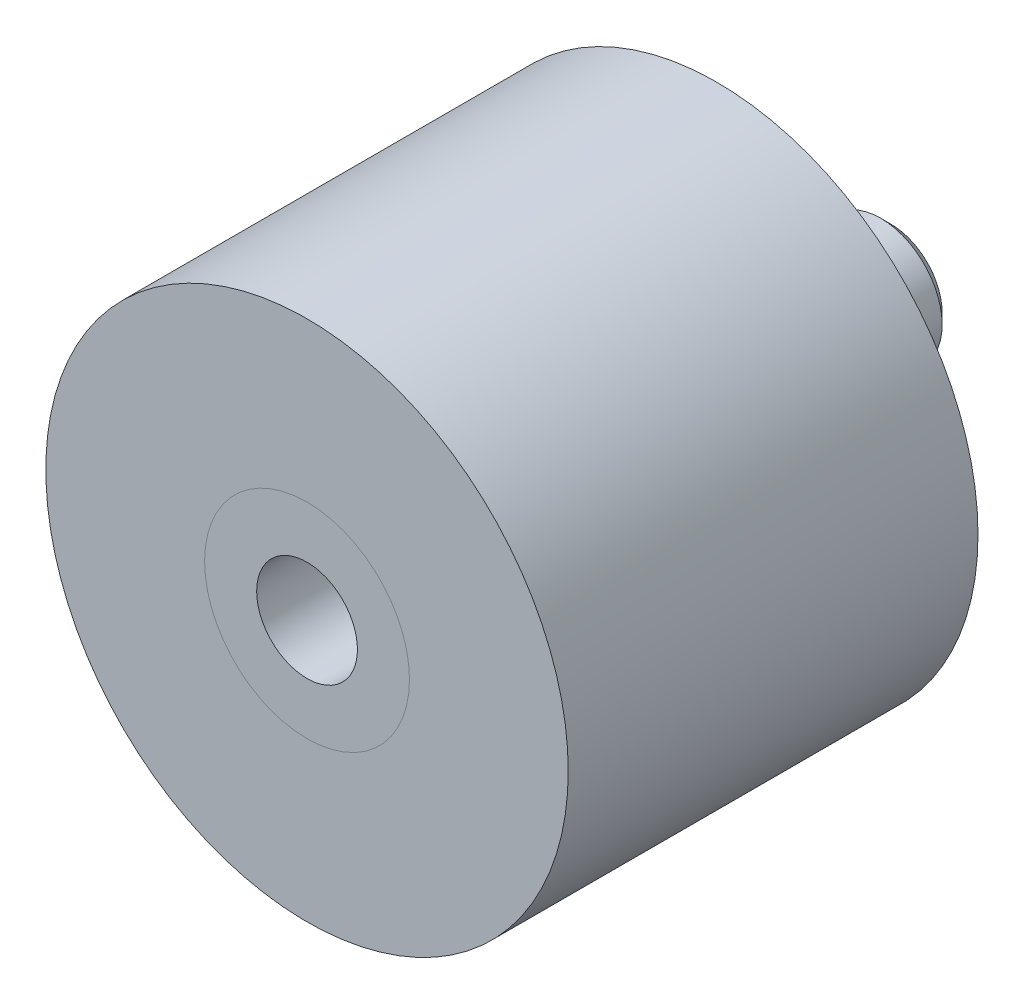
ISO-10303-21;
HEADER;
FILE_DESCRIPTION(('STEP AP214'),'2;1');
FILE_NAME('part.step','',(''),(''),'','','');
FILE_SCHEMA(('AUTOMOTIVE_DESIGN { 1 0 10303 214 1 1 1 1 }'));
ENDSEC;
DATA;
#1=APPLICATION_CONTEXT('core data for automotive mechanical design processes');
#2=APPLICATION_PROTOCOL_DEFINITION('international standard','automotive_design',2000,#1);
#3=PRODUCT_CONTEXT('',#1,'mechanical');
#4=PRODUCT('Part','Part','',(#3));
#5=PRODUCT_RELATED_PRODUCT_CATEGORY('part','',(#4));
#6=PRODUCT_DEFINITION_FORMATION('','',#4);
#7=PRODUCT_DEFINITION_CONTEXT('part definition',#1,'design');
#8=PRODUCT_DEFINITION('design','',#6,#7);
#9=PRODUCT_DEFINITION_SHAPE('','',#8);
#10=(LENGTH_UNIT() NAMED_UNIT(*) SI_UNIT(.MILLI.,.METRE.));
#11=(NAMED_UNIT(*) PLANE_ANGLE_UNIT() SI_UNIT($,.RADIAN.));
#12=(NAMED_UNIT(*) SI_UNIT($,.STERADIAN.) SOLID_ANGLE_UNIT());
#13=UNCERTAINTY_MEASURE_WITH_UNIT(LENGTH_MEASURE(1.E-05),#10,'distance_accuracy_value','');
#14=(GEOMETRIC_REPRESENTATION_CONTEXT(3) GLOBAL_UNCERTAINTY_ASSIGNED_CONTEXT((#13)) GLOBAL_UNIT_ASSIGNED_CONTEXT((#10,
#11,#12)) REPRESENTATION_CONTEXT('',''));
#15=CARTESIAN_POINT('',(0.,0.,0.));
#16=DIRECTION('',(0.,0.,1.));
#17=DIRECTION('',(1.,0.,0.));
#18=AXIS2_PLACEMENT_3D('',#15,#16,#17);
#19=CARTESIAN_POINT('',(0.,0.,9.73));
#20=DIRECTION('',(0.,0.,-1.));
#21=DIRECTION('',(-1.,0.,0.));
#22=AXIS2_PLACEMENT_3D('',#19,#20,#21);
#23=PLANE('',#22);
#24=CARTESIAN_POINT('',(0.,0.,9.73));
#25=DIRECTION('',(0.,0.,-1.));
#26=DIRECTION('',(-1.,0.,0.));
#27=AXIS2_PLACEMENT_3D('',#24,#25,#26);
#28=CIRCLE('',#27,2.4585);
#29=CARTESIAN_POINT('',(-2.4585,0.,9.73));
#30=VERTEX_POINT('',#29);
#31=EDGE_CURVE('P0_E19',#30,#30,#28,.F.);
#32=ORIENTED_EDGE('',*,*,#31,.T.);
#33=EDGE_LOOP('',(#32));
#34=FACE_BOUND('',#33,.T.);
#35=ADVANCED_FACE('P0_F16',(#34),#23,.F.);
#36=CARTESIAN_POINT('',(0.,0.,14.9));
#37=DIRECTION('',(0.,0.,-1.));
#38=DIRECTION('',(-1.,0.,0.));
#39=AXIS2_PLACEMENT_3D('',#36,#37,#38);
#40=CYLINDRICAL_SURFACE('',#39,2.4585);
#41=ORIENTED_EDGE('',*,*,#31,.F.);
#42=EDGE_LOOP('',(#41));
#43=FACE_BOUND('',#42,.T.);
#44=CARTESIAN_POINT('',(0.,0.,15.));
#45=DIRECTION('',(0.,0.,-1.));
#46=DIRECTION('',(-1.,0.,0.));
#47=AXIS2_PLACEMENT_3D('',#44,#45,#46);
#48=CIRCLE('',#47,2.4585);
#49=CARTESIAN_POINT('',(-2.4585,0.,15.));
#50=VERTEX_POINT('',#49);
#51=EDGE_CURVE('P0_E99',#50,#50,#48,.T.);
#52=ORIENTED_EDGE('',*,*,#51,.F.);
#53=EDGE_LOOP('',(#52));
#54=FACE_BOUND('',#53,.T.);
#55=ADVANCED_FACE('P0_F107',(#43,#54),#40,.F.);
#56=CARTESIAN_POINT('',(0.,0.,15.));
#57=DIRECTION('',(0.,0.,1.));
#58=DIRECTION('',(1.,0.,0.));
#59=AXIS2_PLACEMENT_3D('',#56,#57,#58);
#60=PLANE('',#59);
#61=ORIENTED_EDGE('',*,*,#51,.T.);
#62=EDGE_LOOP('',(#61));
#63=FACE_BOUND('',#62,.T.);
#64=CARTESIAN_POINT('',(0.,0.,15.));
#65=DIRECTION('',(0.,0.,1.));
#66=DIRECTION('',(1.,0.,0.));
#67=AXIS2_PLACEMENT_3D('',#64,#65,#66);
#68=CIRCLE('',#67,5.);
#69=CARTESIAN_POINT('',(5.,0.,15.));
#70=VERTEX_POINT('',#69);
#71=EDGE_CURVE('P0_E97',#70,#70,#68,.F.);
#72=ORIENTED_EDGE('',*,*,#71,.F.);
#73=EDGE_LOOP('',(#72));
#74=FACE_BOUND('',#73,.T.);
#75=ADVANCED_FACE('P0_F110',(#63,#74),#60,.T.);
#76=CARTESIAN_POINT('',(0.,0.,10.));
#77=DIRECTION('',(0.,0.,1.));
#78=DIRECTION('',(1.,0.,0.));
#79=AXIS2_PLACEMENT_3D('',#76,#77,#78);
#80=CYLINDRICAL_SURFACE('',#79,5.);
#81=ORIENTED_EDGE('',*,*,#71,.T.);
#82=EDGE_LOOP('',(#81));
#83=FACE_BOUND('',#82,.T.);
#84=CARTESIAN_POINT('',(0.,0.,5.));
#85=DIRECTION('',(0.,0.,1.));
#86=DIRECTION('',(1.,0.,0.));
#87=AXIS2_PLACEMENT_3D('',#84,#85,#86);
#88=CIRCLE('',#87,5.);
#89=CARTESIAN_POINT('',(5.,0.,5.));
#90=VERTEX_POINT('',#89);
#91=EDGE_CURVE('P0_E80',#90,#90,#88,.F.);
#92=ORIENTED_EDGE('',*,*,#91,.F.);
#93=EDGE_LOOP('',(#92));
#94=FACE_BOUND('',#93,.T.);
#95=ADVANCED_FACE('P0_F116',(#83,#94),#80,.T.);
#96=CARTESIAN_POINT('',(0.,0.,5.));
#97=DIRECTION('',(0.,0.,1.));
#98=DIRECTION('',(1.,0.,0.));
#99=AXIS2_PLACEMENT_3D('',#96,#97,#98);
#100=PLANE('',#99);
#101=ORIENTED_EDGE('',*,*,#91,.T.);
#102=EDGE_LOOP('',(#101));
#103=FACE_BOUND('',#102,.T.);
#104=DIRECTION('',(0.303957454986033,0.952685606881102,0.));
#105=VECTOR('',#104,1.);
#106=CARTESIAN_POINT('',(8.88438226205,1.93784721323,5.));
#107=LINE('',#106,#105);
#108=CARTESIAN_POINT('',(8.88438226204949,1.93784721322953,5.));
#109=VERTEX_POINT('',#108);
#110=CARTESIAN_POINT('',(6.1204160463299,-6.72517712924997,5.));
#111=VERTEX_POINT('',#110);
#112=EDGE_CURVE('P0_E66',#109,#111,#107,.F.);
#113=ORIENTED_EDGE('',*,*,#112,.F.);
#114=DIRECTION('',(-0.673071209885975,0.739577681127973,0.));
#115=VECTOR('',#114,1.);
#116=CARTESIAN_POINT('',(2.76396621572,8.66302434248,5.));
#117=LINE('',#116,#115);
#118=CARTESIAN_POINT('',(2.76396621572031,8.66302434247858,5.));
#119=VERTEX_POINT('',#118);
#120=EDGE_CURVE('P0_E71',#119,#109,#117,.F.);
#121=ORIENTED_EDGE('',*,*,#120,.F.);
#122=DIRECTION('',(-0.977028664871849,-0.213107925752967,0.));
#123=VECTOR('',#122,1.);
#124=CARTESIAN_POINT('',(-6.12041604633,6.72517712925,5.));
#125=LINE('',#124,#123);
#126=CARTESIAN_POINT('',(-6.1204160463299,6.72517712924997,5.));
#127=VERTEX_POINT('',#126);
#128=EDGE_CURVE('P0_E254',#127,#119,#125,.F.);
#129=ORIENTED_EDGE('',*,*,#128,.F.);
#130=DIRECTION('',(-0.303957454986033,-0.952685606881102,0.));
#131=VECTOR('',#130,1.);
#132=CARTESIAN_POINT('',(-8.88438226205,-1.93784721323,5.));
#133=LINE('',#132,#131);
#134=CARTESIAN_POINT('',(-8.88438226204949,-1.93784721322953,5.));
#135=VERTEX_POINT('',#134);
#136=EDGE_CURVE('P0_E257',#135,#127,#133,.F.);
#137=ORIENTED_EDGE('',*,*,#136,.F.);
#138=DIRECTION('',(0.673071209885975,-0.739577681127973,0.));
#139=VECTOR('',#138,1.);
#140=CARTESIAN_POINT('',(-2.76396621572,-8.66302434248,5.));
#141=LINE('',#140,#139);
#142=CARTESIAN_POINT('',(-2.76396621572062,-8.66302434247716,5.));
#143=VERTEX_POINT('',#142);
#144=EDGE_CURVE('P0_E240',#143,#135,#141,.F.);
#145=ORIENTED_EDGE('',*,*,#144,.F.);
#146=DIRECTION('',(0.977028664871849,0.213107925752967,0.));
#147=VECTOR('',#146,1.);
#148=CARTESIAN_POINT('',(6.12041604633,-6.72517712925,5.));
#149=LINE('',#148,#147);
#150=EDGE_CURVE('P0_E84',#111,#143,#149,.F.);
#151=ORIENTED_EDGE('',*,*,#150,.F.);
#152=EDGE_LOOP('',(#113,#121,#129,#137,#145,#151));
#153=FACE_BOUND('',#152,.T.);
#154=ADVANCED_FACE('P0_F82',(#103,#153),#100,.T.);
#155=CARTESIAN_POINT('',(2.76396621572,8.66302434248,5.));
#156=DIRECTION('',(0.739577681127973,0.673071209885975,0.));
#157=DIRECTION('',(-0.673071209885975,0.739577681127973,0.));
#158=AXIS2_PLACEMENT_3D('',#155,#156,#157);
#159=PLANE('',#158);
#160=DIRECTION('',(0.,0.,1.));
#161=VECTOR('',#160,1.);
#162=CARTESIAN_POINT('',(8.88438226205,1.93784721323,5.));
#163=LINE('',#162,#161);
#164=CARTESIAN_POINT('',(8.88438226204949,1.93784721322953,2.45));
#165=VERTEX_POINT('',#164);
#166=EDGE_CURVE('P0_E73',#165,#109,#163,.T.);
#167=ORIENTED_EDGE('',*,*,#166,.F.);
#168=DIRECTION('',(0.673071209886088,-0.73957768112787,0.));
#169=VECTOR('',#168,1.);
#170=CARTESIAN_POINT('',(2.76396621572,8.66302434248,2.45));
#171=LINE('',#170,#169);
#172=CARTESIAN_POINT('',(2.76396621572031,8.66302434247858,2.45));
#173=VERTEX_POINT('',#172);
#174=EDGE_CURVE('P0_E248',#173,#165,#171,.T.);
#175=ORIENTED_EDGE('',*,*,#174,.F.);
#176=DIRECTION('',(0.,0.,1.));
#177=VECTOR('',#176,1.);
#178=CARTESIAN_POINT('',(2.76396621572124,8.66302434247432,5.));
#179=LINE('',#178,#177);
#180=EDGE_CURVE('P0_E76',#119,#173,#179,.F.);
#181=ORIENTED_EDGE('',*,*,#180,.F.);
#182=ORIENTED_EDGE('',*,*,#120,.T.);
#183=EDGE_LOOP('',(#167,#175,#181,#182));
#184=FACE_BOUND('',#183,.T.);
#185=ADVANCED_FACE('P0_F72',(#184),#159,.T.);
#186=CARTESIAN_POINT('',(8.88438226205,1.93784721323,5.));
#187=DIRECTION('',(0.952685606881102,-0.303957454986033,0.));
#188=DIRECTION('',(0.303957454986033,0.952685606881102,0.));
#189=AXIS2_PLACEMENT_3D('',#186,#187,#188);
#190=PLANE('',#189);
#191=DIRECTION('',(0.,0.,1.));
#192=VECTOR('',#191,1.);
#193=CARTESIAN_POINT('',(6.12041604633,-6.72517712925,5.));
#194=LINE('',#193,#192);
#195=CARTESIAN_POINT('',(6.1204160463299,-6.72517712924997,2.45));
#196=VERTEX_POINT('',#195);
#197=EDGE_CURVE('P0_E86',#196,#111,#194,.T.);
#198=ORIENTED_EDGE('',*,*,#197,.F.);
#199=DIRECTION('',(-0.303957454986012,-0.952685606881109,0.));
#200=VECTOR('',#199,1.);
#201=CARTESIAN_POINT('',(8.88438226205,1.93784721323,2.45));
#202=LINE('',#201,#200);
#203=EDGE_CURVE('P0_E90',#165,#196,#202,.T.);
#204=ORIENTED_EDGE('',*,*,#203,.F.);
#205=ORIENTED_EDGE('',*,*,#166,.T.);
#206=ORIENTED_EDGE('',*,*,#112,.T.);
#207=EDGE_LOOP('',(#198,#204,#205,#206));
#208=FACE_BOUND('',#207,.T.);
#209=ADVANCED_FACE('P0_F88',(#208),#190,.T.);
#210=CARTESIAN_POINT('',(6.12041604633,-6.72517712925,5.));
#211=DIRECTION('',(0.213107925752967,-0.977028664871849,0.));
#212=DIRECTION('',(0.977028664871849,0.213107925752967,0.));
#213=AXIS2_PLACEMENT_3D('',#210,#211,#212);
#214=PLANE('',#213);
#215=DIRECTION('',(0.,0.,1.));
#216=VECTOR('',#215,1.);
#217=CARTESIAN_POINT('',(-2.76396621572,-8.66302434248,5.));
#218=LINE('',#217,#216);
#219=CARTESIAN_POINT('',(-2.76396621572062,-8.66302434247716,2.45));
#220=VERTEX_POINT('',#219);
#221=EDGE_CURVE('P0_E236',#220,#143,#218,.T.);
#222=ORIENTED_EDGE('',*,*,#221,.F.);
#223=DIRECTION('',(-0.977028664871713,-0.213107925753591,0.));
#224=VECTOR('',#223,1.);
#225=CARTESIAN_POINT('',(6.12041604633,-6.72517712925,2.45));
#226=LINE('',#225,#224);
#227=EDGE_CURVE('P0_E239',#196,#220,#226,.T.);
#228=ORIENTED_EDGE('',*,*,#227,.F.);
#229=ORIENTED_EDGE('',*,*,#197,.T.);
#230=ORIENTED_EDGE('',*,*,#150,.T.);
#231=EDGE_LOOP('',(#222,#228,#229,#230));
#232=FACE_BOUND('',#231,.T.);
#233=ADVANCED_FACE('P0_F137',(#232),#214,.T.);
#234=CARTESIAN_POINT('',(-2.76396621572,-8.66302434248,5.));
#235=DIRECTION('',(-0.739577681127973,-0.673071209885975,0.));
#236=DIRECTION('',(0.673071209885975,-0.739577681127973,0.));
#237=AXIS2_PLACEMENT_3D('',#234,#235,#236);
#238=PLANE('',#237);
#239=DIRECTION('',(0.,0.,1.));
#240=VECTOR('',#239,1.);
#241=CARTESIAN_POINT('',(-8.88438226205,-1.93784721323,5.));
#242=LINE('',#241,#240);
#243=CARTESIAN_POINT('',(-8.88438226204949,-1.93784721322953,2.45));
#244=VERTEX_POINT('',#243);
#245=EDGE_CURVE('P0_E245',#244,#135,#242,.T.);
#246=ORIENTED_EDGE('',*,*,#245,.F.);
#247=DIRECTION('',(-0.673071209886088,0.73957768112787,0.));
#248=VECTOR('',#247,1.);
#249=CARTESIAN_POINT('',(-2.76396621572,-8.66302434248,2.45));
#250=LINE('',#249,#248);
#251=EDGE_CURVE('P0_E243',#220,#244,#250,.T.);
#252=ORIENTED_EDGE('',*,*,#251,.F.);
#253=ORIENTED_EDGE('',*,*,#221,.T.);
#254=ORIENTED_EDGE('',*,*,#144,.T.);
#255=EDGE_LOOP('',(#246,#252,#253,#254));
#256=FACE_BOUND('',#255,.T.);
#257=ADVANCED_FACE('P0_F134',(#256),#238,.T.);
#258=CARTESIAN_POINT('',(-8.88438226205,-1.93784721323,5.));
#259=DIRECTION('',(-0.952685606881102,0.303957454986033,0.));
#260=DIRECTION('',(-0.303957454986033,-0.952685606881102,0.));
#261=AXIS2_PLACEMENT_3D('',#258,#259,#260);
#262=PLANE('',#261);
#263=DIRECTION('',(0.,0.,1.));
#264=VECTOR('',#263,1.);
#265=CARTESIAN_POINT('',(-6.12041604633,6.72517712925,5.));
#266=LINE('',#265,#264);
#267=CARTESIAN_POINT('',(-6.1204160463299,6.72517712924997,2.45));
#268=VERTEX_POINT('',#267);
#269=EDGE_CURVE('P0_E34',#268,#127,#266,.T.);
#270=ORIENTED_EDGE('',*,*,#269,.F.);
#271=DIRECTION('',(0.303957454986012,0.952685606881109,0.));
#272=VECTOR('',#271,1.);
#273=CARTESIAN_POINT('',(-8.88438226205,-1.93784721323,2.45));
#274=LINE('',#273,#272);
#275=EDGE_CURVE('P0_E25',#244,#268,#274,.T.);
#276=ORIENTED_EDGE('',*,*,#275,.F.);
#277=ORIENTED_EDGE('',*,*,#245,.T.);
#278=ORIENTED_EDGE('',*,*,#136,.T.);
#279=EDGE_LOOP('',(#270,#276,#277,#278));
#280=FACE_BOUND('',#279,.T.);
#281=ADVANCED_FACE('P0_F127',(#280),#262,.T.);
#282=CARTESIAN_POINT('',(-6.12041604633,6.72517712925,5.));
#283=DIRECTION('',(-0.213107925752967,0.977028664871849,0.));
#284=DIRECTION('',(-0.977028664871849,-0.213107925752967,0.));
#285=AXIS2_PLACEMENT_3D('',#282,#283,#284);
#286=PLANE('',#285);
#287=ORIENTED_EDGE('',*,*,#180,.T.);
#288=DIRECTION('',(0.977028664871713,0.213107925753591,0.));
#289=VECTOR('',#288,1.);
#290=CARTESIAN_POINT('',(-6.12041604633,6.72517712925,2.45));
#291=LINE('',#290,#289);
#292=EDGE_CURVE('P0_E11',#268,#173,#291,.T.);
#293=ORIENTED_EDGE('',*,*,#292,.F.);
#294=ORIENTED_EDGE('',*,*,#269,.T.);
#295=ORIENTED_EDGE('',*,*,#128,.T.);
#296=EDGE_LOOP('',(#287,#293,#294,#295));
#297=FACE_BOUND('',#296,.T.);
#298=ADVANCED_FACE('P0_F121',(#297),#286,.T.);
#299=CARTESIAN_POINT('',(0.,0.,2.45));
#300=DIRECTION('',(0.,0.,-1.));
#301=DIRECTION('',(-1.,0.,0.));
#302=AXIS2_PLACEMENT_3D('',#299,#300,#301);
#303=PLANE('',#302);
#304=ORIENTED_EDGE('',*,*,#275,.T.);
#305=ORIENTED_EDGE('',*,*,#292,.T.);
#306=ORIENTED_EDGE('',*,*,#174,.T.);
#307=ORIENTED_EDGE('',*,*,#203,.T.);
#308=ORIENTED_EDGE('',*,*,#227,.T.);
#309=ORIENTED_EDGE('',*,*,#251,.T.);
#310=EDGE_LOOP('',(#304,#305,#306,#307,#308,#309));
#311=FACE_BOUND('',#310,.T.);
#312=ADVANCED_FACE('P0_F119',(#311),#303,.T.);
#313=CLOSED_SHELL('',(#35,#55,#75,#95,#154,#185,#209,#233,#257,#281,#298,#312));
#314=MANIFOLD_SOLID_BREP('P0_B1',#313);
#315=CARTESIAN_POINT('',(0.,0.,0.));
#316=DIRECTION('',(0.,0.,1.));
#317=DIRECTION('',(1.,0.,0.));
#318=AXIS2_PLACEMENT_3D('',#315,#316,#317);
#319=PLANE('',#318);
#320=DIRECTION('',(-0.866025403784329,0.50000000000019,0.));
#321=VECTOR('',#320,1.);
#322=CARTESIAN_POINT('',(-7.5,-4.33012701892,0.));
#323=LINE('',#322,#321);
#324=CARTESIAN_POINT('',(-7.5,-4.33012701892,0.));
#325=VERTEX_POINT('',#324);
#326=CARTESIAN_POINT('',(-9.36949879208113E-13,-8.66025403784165,0.));
#327=VERTEX_POINT('',#326);
#328=EDGE_CURVE('P1_E212',#325,#327,#323,.F.);
#329=ORIENTED_EDGE('',*,*,#328,.F.);
#330=DIRECTION('',(0.,1.,0.));
#331=VECTOR('',#330,1.);
#332=CARTESIAN_POINT('',(-7.5,4.33012701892,0.));
#333=LINE('',#332,#331);
#334=CARTESIAN_POINT('',(-7.49999999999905,4.33012701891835,0.));
#335=VERTEX_POINT('',#334);
#336=EDGE_CURVE('P1_E217',#335,#325,#333,.F.);
#337=ORIENTED_EDGE('',*,*,#336,.F.);
#338=DIRECTION('',(0.866025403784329,0.50000000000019,0.));
#339=VECTOR('',#338,1.);
#340=CARTESIAN_POINT('',(0.,8.66025403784,0.));
#341=LINE('',#340,#339);
#342=CARTESIAN_POINT('',(9.58941740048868E-13,8.66025403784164,0.));
#343=VERTEX_POINT('',#342);
#344=EDGE_CURVE('P1_E120',#343,#335,#341,.F.);
#345=ORIENTED_EDGE('',*,*,#344,.F.);
#346=DIRECTION('',(0.866025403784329,-0.50000000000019,0.));
#347=VECTOR('',#346,1.);
#348=CARTESIAN_POINT('',(7.5,4.33012701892,0.));
#349=LINE('',#348,#347);
#350=CARTESIAN_POINT('',(7.5,4.33012701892,0.));
#351=VERTEX_POINT('',#350);
#352=EDGE_CURVE('P1_E103',#351,#343,#349,.F.);
#353=ORIENTED_EDGE('',*,*,#352,.F.);
#354=DIRECTION('',(0.,1.,0.));
#355=VECTOR('',#354,1.);
#356=CARTESIAN_POINT('',(7.5,-4.33012701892,0.));
#357=LINE('',#356,#355);
#358=CARTESIAN_POINT('',(7.49999999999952,-4.33012701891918,0.));
#359=VERTEX_POINT('',#358);
#360=EDGE_CURVE('P1_E108',#359,#351,#357,.T.);
#361=ORIENTED_EDGE('',*,*,#360,.F.);
#362=DIRECTION('',(-0.866025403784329,-0.50000000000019,0.));
#363=VECTOR('',#362,1.);
#364=CARTESIAN_POINT('',(0.,-8.66025403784,0.));
#365=LINE('',#364,#363);
#366=EDGE_CURVE('P1_E207',#327,#359,#365,.F.);
#367=ORIENTED_EDGE('',*,*,#366,.F.);
#368=EDGE_LOOP('',(#329,#337,#345,#353,#361,#367));
#369=FACE_BOUND('',#368,.T.);
#370=ADVANCED_FACE('P1_F16',(#369),#319,.F.);
#371=CARTESIAN_POINT('',(0.,0.,2.45));
#372=DIRECTION('',(0.,0.,-1.));
#373=DIRECTION('',(-1.,0.,0.));
#374=AXIS2_PLACEMENT_3D('',#371,#372,#373);
#375=PLANE('',#374);
#376=DIRECTION('',(-0.303957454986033,-0.952685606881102,0.));
#377=VECTOR('',#376,1.);
#378=CARTESIAN_POINT('',(-8.88438226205,-1.93784721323,2.45));
#379=LINE('',#378,#377);
#380=CARTESIAN_POINT('',(-6.12041604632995,6.72517712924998,2.45));
#381=VERTEX_POINT('',#380);
#382=CARTESIAN_POINT('',(-8.88438226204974,-1.93784721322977,2.45));
#383=VERTEX_POINT('',#382);
#384=EDGE_CURVE('P1_E199',#381,#383,#379,.T.);
#385=ORIENTED_EDGE('',*,*,#384,.T.);
#386=DIRECTION('',(0.673071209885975,-0.739577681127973,0.));
#387=VECTOR('',#386,1.);
#388=CARTESIAN_POINT('',(-2.76396621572,-8.66302434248,2.45));
#389=LINE('',#388,#387);
#390=CARTESIAN_POINT('',(-2.76396621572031,-8.66302434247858,2.45));
#391=VERTEX_POINT('',#390);
#392=EDGE_CURVE('P1_E194',#383,#391,#389,.T.);
#393=ORIENTED_EDGE('',*,*,#392,.T.);
#394=DIRECTION('',(0.977028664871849,0.213107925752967,0.));
#395=VECTOR('',#394,1.);
#396=CARTESIAN_POINT('',(6.12041604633,-6.72517712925,2.45));
#397=LINE('',#396,#395);
#398=CARTESIAN_POINT('',(6.12041604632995,-6.72517712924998,2.45));
#399=VERTEX_POINT('',#398);
#400=EDGE_CURVE('P1_E189',#391,#399,#397,.T.);
#401=ORIENTED_EDGE('',*,*,#400,.T.);
#402=DIRECTION('',(0.303957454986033,0.952685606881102,0.));
#403=VECTOR('',#402,1.);
#404=CARTESIAN_POINT('',(8.88438226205,1.93784721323,2.45));
#405=LINE('',#404,#403);
#406=CARTESIAN_POINT('',(8.88438226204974,1.93784721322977,2.45));
#407=VERTEX_POINT('',#406);
#408=EDGE_CURVE('P1_E184',#399,#407,#405,.T.);
#409=ORIENTED_EDGE('',*,*,#408,.T.);
#410=DIRECTION('',(-0.673071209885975,0.739577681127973,0.));
#411=VECTOR('',#410,1.);
#412=CARTESIAN_POINT('',(2.76396621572,8.66302434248,2.45));
#413=LINE('',#412,#411);
#414=CARTESIAN_POINT('',(2.76396621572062,8.66302434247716,2.45));
#415=VERTEX_POINT('',#414);
#416=EDGE_CURVE('P1_E177',#407,#415,#413,.T.);
#417=ORIENTED_EDGE('',*,*,#416,.T.);
#418=DIRECTION('',(-0.977028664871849,-0.213107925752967,0.));
#419=VECTOR('',#418,1.);
#420=CARTESIAN_POINT('',(-6.12041604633,6.72517712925,2.45));
#421=LINE('',#420,#419);
#422=EDGE_CURVE('P1_E204',#415,#381,#421,.T.);
#423=ORIENTED_EDGE('',*,*,#422,.T.);
#424=EDGE_LOOP('',(#385,#393,#401,#409,#417,#423));
#425=FACE_BOUND('',#424,.T.);
#426=ADVANCED_FACE('P1_F414',(#425),#375,.F.);
#427=CARTESIAN_POINT('',(7.5,-4.33012701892,0.));
#428=DIRECTION('',(-1.,0.,0.));
#429=DIRECTION('',(0.,0.,1.));
#430=AXIS2_PLACEMENT_3D('',#427,#428,#429);
#431=PLANE('',#430);
#432=DIRECTION('',(0.,0.,1.));
#433=VECTOR('',#432,1.);
#434=CARTESIAN_POINT('',(7.5,4.33012701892,0.));
#435=LINE('',#434,#433);
#436=CARTESIAN_POINT('',(7.5,4.33012701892,-3.5));
#437=VERTEX_POINT('',#436);
#438=EDGE_CURVE('P1_E110',#437,#351,#435,.T.);
#439=ORIENTED_EDGE('',*,*,#438,.F.);
#440=DIRECTION('',(0.,1.,0.));
#441=VECTOR('',#440,1.);
#442=CARTESIAN_POINT('',(7.5,0.,-3.5));
#443=LINE('',#442,#441);
#444=CARTESIAN_POINT('',(7.49999999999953,-4.33012701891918,-3.5));
#445=VERTEX_POINT('',#444);
#446=EDGE_CURVE('P1_E175',#445,#437,#443,.T.);
#447=ORIENTED_EDGE('',*,*,#446,.F.);
#448=DIRECTION('',(0.,0.,1.));
#449=VECTOR('',#448,1.);
#450=CARTESIAN_POINT('',(7.4999999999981,-4.33012701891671,0.));
#451=LINE('',#450,#449);
#452=EDGE_CURVE('P1_E113',#359,#445,#451,.F.);
#453=ORIENTED_EDGE('',*,*,#452,.F.);
#454=ORIENTED_EDGE('',*,*,#360,.T.);
#455=EDGE_LOOP('',(#439,#447,#453,#454));
#456=FACE_BOUND('',#455,.T.);
#457=ADVANCED_FACE('P1_F109',(#456),#431,.T.);
#458=CARTESIAN_POINT('',(7.5,4.33012701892,0.));
#459=DIRECTION('',(-0.50000000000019,-0.866025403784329,0.));
#460=DIRECTION('',(0.866025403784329,-0.50000000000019,0.));
#461=AXIS2_PLACEMENT_3D('',#458,#459,#460);
#462=PLANE('',#461);
#463=DIRECTION('',(0.,0.,1.));
#464=VECTOR('',#463,1.);
#465=CARTESIAN_POINT('',(0.,8.66025403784,0.));
#466=LINE('',#465,#464);
#467=CARTESIAN_POINT('',(9.58941740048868E-13,8.66025403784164,-3.5));
#468=VERTEX_POINT('',#467);
#469=EDGE_CURVE('P1_E122',#468,#343,#466,.T.);
#470=ORIENTED_EDGE('',*,*,#469,.F.);
#471=DIRECTION('',(-0.866025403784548,0.499999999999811,0.));
#472=VECTOR('',#471,1.);
#473=CARTESIAN_POINT('',(7.5,4.33012701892,-3.5));
#474=LINE('',#473,#472);
#475=EDGE_CURVE('P1_E126',#437,#468,#474,.T.);
#476=ORIENTED_EDGE('',*,*,#475,.F.);
#477=ORIENTED_EDGE('',*,*,#438,.T.);
#478=ORIENTED_EDGE('',*,*,#352,.T.);
#479=EDGE_LOOP('',(#470,#476,#477,#478));
#480=FACE_BOUND('',#479,.T.);
#481=ADVANCED_FACE('P1_F124',(#480),#462,.T.);
#482=CARTESIAN_POINT('',(0.,8.66025403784,0.));
#483=DIRECTION('',(0.50000000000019,-0.866025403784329,0.));
#484=DIRECTION('',(0.866025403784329,0.50000000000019,0.));
#485=AXIS2_PLACEMENT_3D('',#482,#483,#484);
#486=PLANE('',#485);
#487=DIRECTION('',(0.,0.,1.));
#488=VECTOR('',#487,1.);
#489=CARTESIAN_POINT('',(-7.5,4.33012701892,0.));
#490=LINE('',#489,#488);
#491=CARTESIAN_POINT('',(-7.49999999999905,4.33012701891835,-3.5));
#492=VERTEX_POINT('',#491);
#493=EDGE_CURVE('P1_E219',#492,#335,#490,.T.);
#494=ORIENTED_EDGE('',*,*,#493,.F.);
#495=DIRECTION('',(-0.866025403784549,-0.49999999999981,0.));
#496=VECTOR('',#495,1.);
#497=CARTESIAN_POINT('',(0.,8.66025403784,-3.5));
#498=LINE('',#497,#496);
#499=EDGE_CURVE('P1_E171',#468,#492,#498,.T.);
#500=ORIENTED_EDGE('',*,*,#499,.F.);
#501=ORIENTED_EDGE('',*,*,#469,.T.);
#502=ORIENTED_EDGE('',*,*,#344,.T.);
#503=EDGE_LOOP('',(#494,#500,#501,#502));
#504=FACE_BOUND('',#503,.T.);
#505=ADVANCED_FACE('P1_F224',(#504),#486,.T.);
#506=CARTESIAN_POINT('',(-7.5,4.33012701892,0.));
#507=DIRECTION('',(1.,0.,0.));
#508=DIRECTION('',(0.,1.,0.));
#509=AXIS2_PLACEMENT_3D('',#506,#507,#508);
#510=PLANE('',#509);
#511=DIRECTION('',(0.,0.,1.));
#512=VECTOR('',#511,1.);
#513=CARTESIAN_POINT('',(-7.5,-4.33012701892,0.));
#514=LINE('',#513,#512);
#515=CARTESIAN_POINT('',(-7.5,-4.33012701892,-3.5));
#516=VERTEX_POINT('',#515);
#517=EDGE_CURVE('P1_E214',#516,#325,#514,.T.);
#518=ORIENTED_EDGE('',*,*,#517,.F.);
#519=DIRECTION('',(0.,1.,0.));
#520=VECTOR('',#519,1.);
#521=CARTESIAN_POINT('',(-7.5,0.,-3.5));
#522=LINE('',#521,#520);
#523=EDGE_CURVE('P1_E168',#492,#516,#522,.F.);
#524=ORIENTED_EDGE('',*,*,#523,.F.);
#525=ORIENTED_EDGE('',*,*,#493,.T.);
#526=ORIENTED_EDGE('',*,*,#336,.T.);
#527=EDGE_LOOP('',(#518,#524,#525,#526));
#528=FACE_BOUND('',#527,.T.);
#529=ADVANCED_FACE('P1_F235',(#528),#510,.T.);
#530=CARTESIAN_POINT('',(-7.5,-4.33012701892,0.));
#531=DIRECTION('',(0.50000000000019,0.866025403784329,0.));
#532=DIRECTION('',(-0.866025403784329,0.50000000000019,0.));
#533=AXIS2_PLACEMENT_3D('',#530,#531,#532);
#534=PLANE('',#533);
#535=DIRECTION('',(0.,0.,1.));
#536=VECTOR('',#535,1.);
#537=CARTESIAN_POINT('',(0.,-8.66025403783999,0.));
#538=LINE('',#537,#536);
#539=CARTESIAN_POINT('',(-9.36949879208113E-13,-8.66025403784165,-3.5));
#540=VERTEX_POINT('',#539);
#541=EDGE_CURVE('P1_E209',#540,#327,#538,.T.);
#542=ORIENTED_EDGE('',*,*,#541,.F.);
#543=DIRECTION('',(0.866025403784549,-0.499999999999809,0.));
#544=VECTOR('',#543,1.);
#545=CARTESIAN_POINT('',(-7.5,-4.33012701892,-3.5));
#546=LINE('',#545,#544);
#547=EDGE_CURVE('P1_E165',#516,#540,#546,.T.);
#548=ORIENTED_EDGE('',*,*,#547,.F.);
#549=ORIENTED_EDGE('',*,*,#517,.T.);
#550=ORIENTED_EDGE('',*,*,#328,.T.);
#551=EDGE_LOOP('',(#542,#548,#549,#550));
#552=FACE_BOUND('',#551,.T.);
#553=ADVANCED_FACE('P1_F233',(#552),#534,.T.);
#554=CARTESIAN_POINT('',(0.,-8.66025403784,0.));
#555=DIRECTION('',(-0.50000000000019,0.866025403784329,0.));
#556=DIRECTION('',(-0.866025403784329,-0.50000000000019,0.));
#557=AXIS2_PLACEMENT_3D('',#554,#555,#556);
#558=PLANE('',#557);
#559=ORIENTED_EDGE('',*,*,#452,.T.);
#560=DIRECTION('',(0.866025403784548,0.499999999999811,0.));
#561=VECTOR('',#560,1.);
#562=CARTESIAN_POINT('',(0.,-8.66025403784,-3.5));
#563=LINE('',#562,#561);
#564=EDGE_CURVE('P1_E162',#540,#445,#563,.T.);
#565=ORIENTED_EDGE('',*,*,#564,.F.);
#566=ORIENTED_EDGE('',*,*,#541,.T.);
#567=ORIENTED_EDGE('',*,*,#366,.T.);
#568=EDGE_LOOP('',(#559,#565,#566,#567));
#569=FACE_BOUND('',#568,.T.);
#570=ADVANCED_FACE('P1_F230',(#569),#558,.T.);
#571=CARTESIAN_POINT('',(-6.12041604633,6.72517712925,5.));
#572=DIRECTION('',(-0.213107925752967,0.977028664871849,0.));
#573=DIRECTION('',(-0.977028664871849,-0.213107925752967,0.));
#574=AXIS2_PLACEMENT_3D('',#571,#572,#573);
#575=PLANE('',#574);
#576=DIRECTION('',(0.,0.,1.));
#577=VECTOR('',#576,1.);
#578=CARTESIAN_POINT('',(2.76396621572,8.66302434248,5.));
#579=LINE('',#578,#577);
#580=CARTESIAN_POINT('',(2.76396621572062,8.66302434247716,5.));
#581=VERTEX_POINT('',#580);
#582=EDGE_CURVE('P1_E182',#415,#581,#579,.T.);
#583=ORIENTED_EDGE('',*,*,#582,.T.);
#584=DIRECTION('',(-0.977028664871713,-0.213107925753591,0.));
#585=VECTOR('',#584,1.);
#586=CARTESIAN_POINT('',(2.76396621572,8.66302434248,5.));
#587=LINE('',#586,#585);
#588=CARTESIAN_POINT('',(-6.12041604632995,6.72517712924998,5.));
#589=VERTEX_POINT('',#588);
#590=EDGE_CURVE('P1_E160',#581,#589,#587,.T.);
#591=ORIENTED_EDGE('',*,*,#590,.T.);
#592=DIRECTION('',(0.,0.,1.));
#593=VECTOR('',#592,1.);
#594=CARTESIAN_POINT('',(-6.12041604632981,6.72517712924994,5.));
#595=LINE('',#594,#593);
#596=EDGE_CURVE('P1_E201',#589,#381,#595,.F.);
#597=ORIENTED_EDGE('',*,*,#596,.T.);
#598=ORIENTED_EDGE('',*,*,#422,.F.);
#599=EDGE_LOOP('',(#583,#591,#597,#598));
#600=FACE_BOUND('',#599,.T.);
#601=ADVANCED_FACE('P1_F291',(#600),#575,.F.);
#602=CARTESIAN_POINT('',(-8.88438226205,-1.93784721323,5.));
#603=DIRECTION('',(-0.952685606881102,0.303957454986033,0.));
#604=DIRECTION('',(-0.303957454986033,-0.952685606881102,0.));
#605=AXIS2_PLACEMENT_3D('',#602,#603,#604);
#606=PLANE('',#605);
#607=ORIENTED_EDGE('',*,*,#596,.F.);
#608=DIRECTION('',(-0.303957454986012,-0.952685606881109,0.));
#609=VECTOR('',#608,1.);
#610=CARTESIAN_POINT('',(-6.12041604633,6.72517712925,5.));
#611=LINE('',#610,#609);
#612=CARTESIAN_POINT('',(-8.88438226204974,-1.93784721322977,5.));
#613=VERTEX_POINT('',#612);
#614=EDGE_CURVE('P1_E158',#589,#613,#611,.T.);
#615=ORIENTED_EDGE('',*,*,#614,.T.);
#616=DIRECTION('',(0.,0.,1.));
#617=VECTOR('',#616,1.);
#618=CARTESIAN_POINT('',(-8.88438226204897,-1.93784721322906,5.));
#619=LINE('',#618,#617);
#620=EDGE_CURVE('P1_E196',#613,#383,#619,.F.);
#621=ORIENTED_EDGE('',*,*,#620,.T.);
#622=ORIENTED_EDGE('',*,*,#384,.F.);
#623=EDGE_LOOP('',(#607,#615,#621,#622));
#624=FACE_BOUND('',#623,.T.);
#625=ADVANCED_FACE('P1_F287',(#624),#606,.F.);
#626=CARTESIAN_POINT('',(-2.76396621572,-8.66302434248,5.));
#627=DIRECTION('',(-0.739577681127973,-0.673071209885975,0.));
#628=DIRECTION('',(0.673071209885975,-0.739577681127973,0.));
#629=AXIS2_PLACEMENT_3D('',#626,#627,#628);
#630=PLANE('',#629);
#631=ORIENTED_EDGE('',*,*,#620,.F.);
#632=DIRECTION('',(0.673071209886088,-0.73957768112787,0.));
#633=VECTOR('',#632,1.);
#634=CARTESIAN_POINT('',(-8.88438226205,-1.93784721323,5.));
#635=LINE('',#634,#633);
#636=CARTESIAN_POINT('',(-2.76396621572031,-8.66302434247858,5.));
#637=VERTEX_POINT('',#636);
#638=EDGE_CURVE('P1_E156',#613,#637,#635,.T.);
#639=ORIENTED_EDGE('',*,*,#638,.T.);
#640=DIRECTION('',(0.,0.,1.));
#641=VECTOR('',#640,1.);
#642=CARTESIAN_POINT('',(-2.76396621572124,-8.66302434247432,5.));
#643=LINE('',#642,#641);
#644=EDGE_CURVE('P1_E191',#637,#391,#643,.F.);
#645=ORIENTED_EDGE('',*,*,#644,.T.);
#646=ORIENTED_EDGE('',*,*,#392,.F.);
#647=EDGE_LOOP('',(#631,#639,#645,#646));
#648=FACE_BOUND('',#647,.T.);
#649=ADVANCED_FACE('P1_F283',(#648),#630,.F.);
#650=CARTESIAN_POINT('',(6.12041604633,-6.72517712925,5.));
#651=DIRECTION('',(0.213107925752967,-0.977028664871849,0.));
#652=DIRECTION('',(0.977028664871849,0.213107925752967,0.));
#653=AXIS2_PLACEMENT_3D('',#650,#651,#652);
#654=PLANE('',#653);
#655=ORIENTED_EDGE('',*,*,#644,.F.);
#656=DIRECTION('',(0.977028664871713,0.213107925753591,0.));
#657=VECTOR('',#656,1.);
#658=CARTESIAN_POINT('',(-2.76396621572,-8.66302434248,5.));
#659=LINE('',#658,#657);
#660=CARTESIAN_POINT('',(6.12041604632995,-6.72517712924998,5.));
#661=VERTEX_POINT('',#660);
#662=EDGE_CURVE('P1_E152',#637,#661,#659,.T.);
#663=ORIENTED_EDGE('',*,*,#662,.T.);
#664=DIRECTION('',(0.,0.,1.));
#665=VECTOR('',#664,1.);
#666=CARTESIAN_POINT('',(6.12041604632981,-6.72517712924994,5.));
#667=LINE('',#666,#665);
#668=EDGE_CURVE('P1_E186',#661,#399,#667,.F.);
#669=ORIENTED_EDGE('',*,*,#668,.T.);
#670=ORIENTED_EDGE('',*,*,#400,.F.);
#671=EDGE_LOOP('',(#655,#663,#669,#670));
#672=FACE_BOUND('',#671,.T.);
#673=ADVANCED_FACE('P1_F280',(#672),#654,.F.);
#674=CARTESIAN_POINT('',(8.88438226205,1.93784721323,5.));
#675=DIRECTION('',(0.952685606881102,-0.303957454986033,0.));
#676=DIRECTION('',(0.303957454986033,0.952685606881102,0.));
#677=AXIS2_PLACEMENT_3D('',#674,#675,#676);
#678=PLANE('',#677);
#679=ORIENTED_EDGE('',*,*,#668,.F.);
#680=DIRECTION('',(0.303957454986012,0.952685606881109,0.));
#681=VECTOR('',#680,1.);
#682=CARTESIAN_POINT('',(6.12041604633,-6.72517712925,5.));
#683=LINE('',#682,#681);
#684=CARTESIAN_POINT('',(8.88438226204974,1.93784721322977,5.));
#685=VERTEX_POINT('',#684);
#686=EDGE_CURVE('P1_E34',#661,#685,#683,.T.);
#687=ORIENTED_EDGE('',*,*,#686,.T.);
#688=DIRECTION('',(0.,0.,1.));
#689=VECTOR('',#688,1.);
#690=CARTESIAN_POINT('',(8.88438226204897,1.93784721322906,5.));
#691=LINE('',#690,#689);
#692=EDGE_CURVE('P1_E180',#685,#407,#691,.F.);
#693=ORIENTED_EDGE('',*,*,#692,.T.);
#694=ORIENTED_EDGE('',*,*,#408,.F.);
#695=EDGE_LOOP('',(#679,#687,#693,#694));
#696=FACE_BOUND('',#695,.T.);
#697=ADVANCED_FACE('P1_F277',(#696),#678,.F.);
#698=CARTESIAN_POINT('',(2.76396621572,8.66302434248,5.));
#699=DIRECTION('',(0.739577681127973,0.673071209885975,0.));
#700=DIRECTION('',(-0.673071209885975,0.739577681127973,0.));
#701=AXIS2_PLACEMENT_3D('',#698,#699,#700);
#702=PLANE('',#701);
#703=ORIENTED_EDGE('',*,*,#692,.F.);
#704=DIRECTION('',(-0.673071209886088,0.73957768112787,0.));
#705=VECTOR('',#704,1.);
#706=CARTESIAN_POINT('',(8.88438226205,1.93784721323,5.));
#707=LINE('',#706,#705);
#708=EDGE_CURVE('P1_E143',#685,#581,#707,.T.);
#709=ORIENTED_EDGE('',*,*,#708,.T.);
#710=ORIENTED_EDGE('',*,*,#582,.F.);
#711=ORIENTED_EDGE('',*,*,#416,.F.);
#712=EDGE_LOOP('',(#703,#709,#710,#711));
#713=FACE_BOUND('',#712,.T.);
#714=ADVANCED_FACE('P1_F274',(#713),#702,.F.);
#715=CARTESIAN_POINT('',(0.,0.,-3.5));
#716=DIRECTION('',(0.,0.,1.));
#717=DIRECTION('',(1.,0.,0.));
#718=AXIS2_PLACEMENT_3D('',#715,#716,#717);
#719=PLANE('',#718);
#720=CARTESIAN_POINT('',(0.,0.,-3.5));
#721=DIRECTION('',(0.,0.,-1.));
#722=DIRECTION('',(-1.,0.,0.));
#723=AXIS2_PLACEMENT_3D('',#720,#721,#722);
#724=CIRCLE('',#723,3.);
#725=CARTESIAN_POINT('',(-3.,0.,-3.5));
#726=VERTEX_POINT('',#725);
#727=EDGE_CURVE('P1_E19',#726,#726,#724,.T.);
#728=ORIENTED_EDGE('',*,*,#727,.T.);
#729=EDGE_LOOP('',(#728));
#730=FACE_BOUND('',#729,.T.);
#731=ORIENTED_EDGE('',*,*,#547,.T.);
#732=ORIENTED_EDGE('',*,*,#564,.T.);
#733=ORIENTED_EDGE('',*,*,#446,.T.);
#734=ORIENTED_EDGE('',*,*,#475,.T.);
#735=ORIENTED_EDGE('',*,*,#499,.T.);
#736=ORIENTED_EDGE('',*,*,#523,.T.);
#737=EDGE_LOOP('',(#731,#732,#733,#734,#735,#736));
#738=FACE_BOUND('',#737,.T.);
#739=ADVANCED_FACE('P1_F227',(#730,#738),#719,.T.);
#740=CARTESIAN_POINT('',(0.,0.,5.));
#741=DIRECTION('',(0.,0.,1.));
#742=DIRECTION('',(1.,0.,0.));
#743=AXIS2_PLACEMENT_3D('',#740,#741,#742);
#744=PLANE('',#743);
#745=CARTESIAN_POINT('',(0.,0.,5.));
#746=DIRECTION('',(0.,0.,1.));
#747=DIRECTION('',(1.,0.,0.));
#748=AXIS2_PLACEMENT_3D('',#745,#746,#747);
#749=CIRCLE('',#748,5.);
#750=CARTESIAN_POINT('',(5.,0.,5.));
#751=VERTEX_POINT('',#750);
#752=EDGE_CURVE('P1_E138',#751,#751,#749,.T.);
#753=ORIENTED_EDGE('',*,*,#752,.T.);
#754=EDGE_LOOP('',(#753));
#755=FACE_BOUND('',#754,.T.);
#756=ORIENTED_EDGE('',*,*,#686,.F.);
#757=ORIENTED_EDGE('',*,*,#662,.F.);
#758=ORIENTED_EDGE('',*,*,#638,.F.);
#759=ORIENTED_EDGE('',*,*,#614,.F.);
#760=ORIENTED_EDGE('',*,*,#590,.F.);
#761=ORIENTED_EDGE('',*,*,#708,.F.);
#762=EDGE_LOOP('',(#756,#757,#758,#759,#760,#761));
#763=FACE_BOUND('',#762,.T.);
#764=ADVANCED_FACE('P1_F268',(#755,#763),#744,.F.);
#765=CARTESIAN_POINT('',(0.,0.,-8.5));
#766=DIRECTION('',(0.,0.,-1.));
#767=DIRECTION('',(-1.,0.,0.));
#768=AXIS2_PLACEMENT_3D('',#765,#766,#767);
#769=CYLINDRICAL_SURFACE('',#768,3.);
#770=ORIENTED_EDGE('',*,*,#727,.F.);
#771=EDGE_LOOP('',(#770));
#772=FACE_BOUND('',#771,.T.);
#773=CARTESIAN_POINT('',(0.,0.,-5.));
#774=DIRECTION('',(0.,0.,-1.));
#775=DIRECTION('',(-1.,0.,0.));
#776=AXIS2_PLACEMENT_3D('',#773,#774,#775);
#777=CIRCLE('',#776,3.);
#778=CARTESIAN_POINT('',(-3.,0.,-5.));
#779=VERTEX_POINT('',#778);
#780=EDGE_CURVE('P1_E136',#779,#779,#777,.T.);
#781=ORIENTED_EDGE('',*,*,#780,.T.);
#782=EDGE_LOOP('',(#781));
#783=FACE_BOUND('',#782,.T.);
#784=ADVANCED_FACE('P1_F264',(#772,#783),#769,.F.);
#785=CARTESIAN_POINT('',(0.,0.,10.));
#786=DIRECTION('',(0.,0.,1.));
#787=DIRECTION('',(1.,0.,0.));
#788=AXIS2_PLACEMENT_3D('',#785,#786,#787);
#789=CYLINDRICAL_SURFACE('',#788,5.);
#790=CARTESIAN_POINT('',(0.,0.,15.));
#791=DIRECTION('',(0.,0.,1.));
#792=DIRECTION('',(1.,0.,0.));
#793=AXIS2_PLACEMENT_3D('',#790,#791,#792);
#794=CIRCLE('',#793,5.);
#795=CARTESIAN_POINT('',(5.,0.,15.));
#796=VERTEX_POINT('',#795);
#797=EDGE_CURVE('P1_E133',#796,#796,#794,.F.);
#798=ORIENTED_EDGE('',*,*,#797,.F.);
#799=EDGE_LOOP('',(#798));
#800=FACE_BOUND('',#799,.T.);
#801=ORIENTED_EDGE('',*,*,#752,.F.);
#802=EDGE_LOOP('',(#801));
#803=FACE_BOUND('',#802,.T.);
#804=ADVANCED_FACE('P1_F260',(#800,#803),#789,.F.);
#805=CARTESIAN_POINT('',(0.,0.,-5.));
#806=DIRECTION('',(0.,0.,1.));
#807=DIRECTION('',(1.,0.,0.));
#808=AXIS2_PLACEMENT_3D('',#805,#806,#807);
#809=PLANE('',#808);
#810=ORIENTED_EDGE('',*,*,#780,.F.);
#811=EDGE_LOOP('',(#810));
#812=FACE_BOUND('',#811,.T.);
#813=CARTESIAN_POINT('',(0.,0.,-5.));
#814=DIRECTION('',(0.,0.,1.));
#815=DIRECTION('',(1.,0.,0.));
#816=AXIS2_PLACEMENT_3D('',#813,#814,#815);
#817=CIRCLE('',#816,12.75);
#818=CARTESIAN_POINT('',(12.75,0.,-5.));
#819=VERTEX_POINT('',#818);
#820=EDGE_CURVE('P1_E25',#819,#819,#817,.T.);
#821=ORIENTED_EDGE('',*,*,#820,.F.);
#822=EDGE_LOOP('',(#821));
#823=FACE_BOUND('',#822,.T.);
#824=ADVANCED_FACE('P1_F253',(#812,#823),#809,.F.);
#825=CARTESIAN_POINT('',(0.,0.,15.));
#826=DIRECTION('',(0.,0.,1.));
#827=DIRECTION('',(1.,0.,0.));
#828=AXIS2_PLACEMENT_3D('',#825,#826,#827);
#829=PLANE('',#828);
#830=ORIENTED_EDGE('',*,*,#797,.T.);
#831=EDGE_LOOP('',(#830));
#832=FACE_BOUND('',#831,.T.);
#833=CARTESIAN_POINT('',(0.,0.,15.));
#834=DIRECTION('',(0.,0.,1.));
#835=DIRECTION('',(1.,0.,0.));
#836=AXIS2_PLACEMENT_3D('',#833,#834,#835);
#837=CIRCLE('',#836,12.75);
#838=CARTESIAN_POINT('',(12.75,0.,15.));
#839=VERTEX_POINT('',#838);
#840=EDGE_CURVE('P1_E11',#839,#839,#837,.F.);
#841=ORIENTED_EDGE('',*,*,#840,.F.);
#842=EDGE_LOOP('',(#841));
#843=FACE_BOUND('',#842,.T.);
#844=ADVANCED_FACE('P1_F247',(#832,#843),#829,.T.);
#845=CARTESIAN_POINT('',(0.,0.,5.));
#846=DIRECTION('',(0.,0.,1.));
#847=DIRECTION('',(1.,0.,0.));
#848=AXIS2_PLACEMENT_3D('',#845,#846,#847);
#849=CYLINDRICAL_SURFACE('',#848,12.75);
#850=ORIENTED_EDGE('',*,*,#820,.T.);
#851=EDGE_LOOP('',(#850));
#852=FACE_BOUND('',#851,.T.);
#853=ORIENTED_EDGE('',*,*,#840,.T.);
#854=EDGE_LOOP('',(#853));
#855=FACE_BOUND('',#854,.T.);
#856=ADVANCED_FACE('P1_F245',(#852,#855),#849,.T.);
#857=CLOSED_SHELL('',(#370,#426,#457,#481,#505,#529,#553,#570,#601,#625,#649,#673,#697,#714,
#739,#764,#784,#804,#824,#844,#856));
#858=MANIFOLD_SOLID_BREP('P1_B1',#857);
#859=CARTESIAN_POINT('',(0.,0.,-13.5));
#860=DIRECTION('',(0.,0.,-1.));
#861=DIRECTION('',(-1.,0.,0.));
#862=AXIS2_PLACEMENT_3D('',#859,#860,#861);
#863=PLANE('',#862);
#864=CARTESIAN_POINT('',(3.81236740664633E-13,3.00238291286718E-13,-13.5000000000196));
#865=DIRECTION('',(-7.62473481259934E-13,-6.0004290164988E-13,1.));
#866=DIRECTION('',(1.,0.,7.62473481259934E-13));
#867=AXIS2_PLACEMENT_3D('',#864,#865,#866);
#868=CIRCLE('',#867,2.50000000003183);
#869=CARTESIAN_POINT('',(2.50000000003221,3.00238291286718E-13,-13.5000000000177));
#870=VERTEX_POINT('',#869);
#871=EDGE_CURVE('P2_E19',#870,#870,#868,.T.);
#872=ORIENTED_EDGE('',*,*,#871,.F.);
#873=EDGE_LOOP('',(#872));
#874=FACE_BOUND('',#873,.T.);
#875=ADVANCED_FACE('P2_F16',(#874),#863,.T.);
#876=CARTESIAN_POINT('',(0.,0.,-12.9999999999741));
#877=DIRECTION('',(-7.62473481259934E-13,-6.0004290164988E-13,1.));
#878=DIRECTION('',(1.,0.,7.62473481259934E-13));
#879=AXIS2_PLACEMENT_3D('',#876,#877,#878);
#880=CONICAL_SURFACE('',#879,3.00000000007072,0.785398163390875);
#881=CARTESIAN_POINT('',(0.,0.,-13.));
#882=DIRECTION('',(0.,0.,-1.));
#883=DIRECTION('',(-1.,0.,0.));
#884=AXIS2_PLACEMENT_3D('',#881,#882,#883);
#885=CIRCLE('',#884,3.);
#886=CARTESIAN_POINT('',(-3.,0.,-13.));
#887=VERTEX_POINT('',#886);
#888=EDGE_CURVE('P2_E96',#887,#887,#885,.F.);
#889=ORIENTED_EDGE('',*,*,#888,.F.);
#890=EDGE_LOOP('',(#889));
#891=FACE_BOUND('',#890,.T.);
#892=ORIENTED_EDGE('',*,*,#871,.T.);
#893=EDGE_LOOP('',(#892));
#894=FACE_BOUND('',#893,.T.);
#895=ADVANCED_FACE('P2_F112',(#891,#894),#880,.T.);
#896=CARTESIAN_POINT('',(0.,0.,-8.5));
#897=DIRECTION('',(0.,0.,-1.));
#898=DIRECTION('',(-1.,0.,0.));
#899=AXIS2_PLACEMENT_3D('',#896,#897,#898);
#900=CYLINDRICAL_SURFACE('',#899,3.);
#901=CARTESIAN_POINT('',(0.,0.,-3.5));
#902=DIRECTION('',(0.,0.,-1.));
#903=DIRECTION('',(-1.,0.,0.));
#904=AXIS2_PLACEMENT_3D('',#901,#902,#903);
#905=CIRCLE('',#904,3.);
#906=CARTESIAN_POINT('',(-3.,0.,-3.5));
#907=VERTEX_POINT('',#906);
#908=EDGE_CURVE('P2_E80',#907,#907,#905,.T.);
#909=ORIENTED_EDGE('',*,*,#908,.T.);
#910=EDGE_LOOP('',(#909));
#911=FACE_BOUND('',#910,.T.);
#912=ORIENTED_EDGE('',*,*,#888,.T.);
#913=EDGE_LOOP('',(#912));
#914=FACE_BOUND('',#913,.T.);
#915=ADVANCED_FACE('P2_F101',(#911,#914),#900,.T.);
#916=CARTESIAN_POINT('',(0.,0.,-3.5));
#917=DIRECTION('',(0.,0.,1.));
#918=DIRECTION('',(1.,0.,0.));
#919=AXIS2_PLACEMENT_3D('',#916,#917,#918);
#920=PLANE('',#919);
#921=ORIENTED_EDGE('',*,*,#908,.F.);
#922=EDGE_LOOP('',(#921));
#923=FACE_BOUND('',#922,.T.);
#924=DIRECTION('',(-0.866025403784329,0.50000000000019,0.));
#925=VECTOR('',#924,1.);
#926=CARTESIAN_POINT('',(-7.5,-4.33012701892,-3.5));
#927=LINE('',#926,#925);
#928=CARTESIAN_POINT('',(-9.36949879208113E-13,-8.66025403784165,-3.5));
#929=VERTEX_POINT('',#928);
#930=CARTESIAN_POINT('',(-7.5,-4.33012701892,-3.5));
#931=VERTEX_POINT('',#930);
#932=EDGE_CURVE('P2_E243',#929,#931,#927,.T.);
#933=ORIENTED_EDGE('',*,*,#932,.T.);
#934=DIRECTION('',(0.,1.,0.));
#935=VECTOR('',#934,1.);
#936=CARTESIAN_POINT('',(-7.5,4.33012701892,-3.5));
#937=LINE('',#936,#935);
#938=CARTESIAN_POINT('',(-7.49999999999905,4.33012701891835,-3.5));
#939=VERTEX_POINT('',#938);
#940=EDGE_CURVE('P2_E226',#931,#939,#937,.T.);
#941=ORIENTED_EDGE('',*,*,#940,.T.);
#942=DIRECTION('',(0.866025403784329,0.50000000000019,0.));
#943=VECTOR('',#942,1.);
#944=CARTESIAN_POINT('',(0.,8.66025403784,-3.5));
#945=LINE('',#944,#943);
#946=CARTESIAN_POINT('',(9.58941740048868E-13,8.66025403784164,-3.5));
#947=VERTEX_POINT('',#946);
#948=EDGE_CURVE('P2_E85',#939,#947,#945,.T.);
#949=ORIENTED_EDGE('',*,*,#948,.T.);
#950=DIRECTION('',(0.866025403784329,-0.50000000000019,0.));
#951=VECTOR('',#950,1.);
#952=CARTESIAN_POINT('',(7.5,4.33012701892,-3.5));
#953=LINE('',#952,#951);
#954=CARTESIAN_POINT('',(7.5,4.33012701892,-3.5));
#955=VERTEX_POINT('',#954);
#956=EDGE_CURVE('P2_E66',#947,#955,#953,.T.);
#957=ORIENTED_EDGE('',*,*,#956,.T.);
#958=DIRECTION('',(0.,1.,0.));
#959=VECTOR('',#958,1.);
#960=CARTESIAN_POINT('',(7.5,-4.33012701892,-3.5));
#961=LINE('',#960,#959);
#962=CARTESIAN_POINT('',(7.49999999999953,-4.33012701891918,-3.5));
#963=VERTEX_POINT('',#962);
#964=EDGE_CURVE('P2_E71',#955,#963,#961,.F.);
#965=ORIENTED_EDGE('',*,*,#964,.T.);
#966=DIRECTION('',(-0.866025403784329,-0.50000000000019,0.));
#967=VECTOR('',#966,1.);
#968=CARTESIAN_POINT('',(0.,-8.66025403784,-3.5));
#969=LINE('',#968,#967);
#970=EDGE_CURVE('P2_E239',#963,#929,#969,.T.);
#971=ORIENTED_EDGE('',*,*,#970,.T.);
#972=EDGE_LOOP('',(#933,#941,#949,#957,#965,#971));
#973=FACE_BOUND('',#972,.T.);
#974=ADVANCED_FACE('P2_F83',(#923,#973),#920,.F.);
#975=CARTESIAN_POINT('',(7.5,-4.33012701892,0.));
#976=DIRECTION('',(-1.,0.,0.));
#977=DIRECTION('',(0.,0.,1.));
#978=AXIS2_PLACEMENT_3D('',#975,#976,#977);
#979=PLANE('',#978);
#980=DIRECTION('',(0.,0.,1.));
#981=VECTOR('',#980,1.);
#982=CARTESIAN_POINT('',(7.5,4.33012701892,0.));
#983=LINE('',#982,#981);
#984=CARTESIAN_POINT('',(7.5,4.33012701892,0.));
#985=VERTEX_POINT('',#984);
#986=EDGE_CURVE('P2_E73',#955,#985,#983,.T.);
#987=ORIENTED_EDGE('',*,*,#986,.T.);
#988=DIRECTION('',(0.,1.,0.));
#989=VECTOR('',#988,1.);
#990=CARTESIAN_POINT('',(7.5,0.,0.));
#991=LINE('',#990,#989);
#992=CARTESIAN_POINT('',(7.49999999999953,-4.33012701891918,0.));
#993=VERTEX_POINT('',#992);
#994=EDGE_CURVE('P2_E234',#993,#985,#991,.T.);
#995=ORIENTED_EDGE('',*,*,#994,.F.);
#996=DIRECTION('',(0.,0.,1.));
#997=VECTOR('',#996,1.);
#998=CARTESIAN_POINT('',(7.4999999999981,-4.33012701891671,0.));
#999=LINE('',#998,#997);
#1000=EDGE_CURVE('P2_E76',#993,#963,#999,.F.);
#1001=ORIENTED_EDGE('',*,*,#1000,.T.);
#1002=ORIENTED_EDGE('',*,*,#964,.F.);
#1003=EDGE_LOOP('',(#987,#995,#1001,#1002));
#1004=FACE_BOUND('',#1003,.T.);
#1005=ADVANCED_FACE('P2_F72',(#1004),#979,.F.);
#1006=CARTESIAN_POINT('',(7.5,4.33012701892,0.));
#1007=DIRECTION('',(-0.50000000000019,-0.866025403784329,0.));
#1008=DIRECTION('',(0.866025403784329,-0.50000000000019,0.));
#1009=AXIS2_PLACEMENT_3D('',#1006,#1007,#1008);
#1010=PLANE('',#1009);
#1011=DIRECTION('',(0.,0.,1.));
#1012=VECTOR('',#1011,1.);
#1013=CARTESIAN_POINT('',(0.,8.66025403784,0.));
#1014=LINE('',#1013,#1012);
#1015=CARTESIAN_POINT('',(9.58941740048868E-13,8.66025403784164,0.));
#1016=VERTEX_POINT('',#1015);
#1017=EDGE_CURVE('P2_E87',#947,#1016,#1014,.T.);
#1018=ORIENTED_EDGE('',*,*,#1017,.T.);
#1019=DIRECTION('',(-0.866025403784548,0.499999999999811,0.));
#1020=VECTOR('',#1019,1.);
#1021=CARTESIAN_POINT('',(7.5,4.33012701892,0.));
#1022=LINE('',#1021,#1020);
#1023=EDGE_CURVE('P2_E91',#985,#1016,#1022,.T.);
#1024=ORIENTED_EDGE('',*,*,#1023,.F.);
#1025=ORIENTED_EDGE('',*,*,#986,.F.);
#1026=ORIENTED_EDGE('',*,*,#956,.F.);
#1027=EDGE_LOOP('',(#1018,#1024,#1025,#1026));
#1028=FACE_BOUND('',#1027,.T.);
#1029=ADVANCED_FACE('P2_F89',(#1028),#1010,.F.);
#1030=CARTESIAN_POINT('',(0.,8.66025403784,0.));
#1031=DIRECTION('',(0.50000000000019,-0.866025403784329,0.));
#1032=DIRECTION('',(0.866025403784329,0.50000000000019,0.));
#1033=AXIS2_PLACEMENT_3D('',#1030,#1031,#1032);
#1034=PLANE('',#1033);
#1035=DIRECTION('',(0.,0.,1.));
#1036=VECTOR('',#1035,1.);
#1037=CARTESIAN_POINT('',(-7.5,4.33012701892,0.));
#1038=LINE('',#1037,#1036);
#1039=CARTESIAN_POINT('',(-7.49999999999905,4.33012701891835,0.));
#1040=VERTEX_POINT('',#1039);
#1041=EDGE_CURVE('P2_E222',#939,#1040,#1038,.T.);
#1042=ORIENTED_EDGE('',*,*,#1041,.T.);
#1043=DIRECTION('',(-0.866025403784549,-0.49999999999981,0.));
#1044=VECTOR('',#1043,1.);
#1045=CARTESIAN_POINT('',(0.,8.66025403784,0.));
#1046=LINE('',#1045,#1044);
#1047=EDGE_CURVE('P2_E225',#1016,#1040,#1046,.T.);
#1048=ORIENTED_EDGE('',*,*,#1047,.F.);
#1049=ORIENTED_EDGE('',*,*,#1017,.F.);
#1050=ORIENTED_EDGE('',*,*,#948,.F.);
#1051=EDGE_LOOP('',(#1042,#1048,#1049,#1050));
#1052=FACE_BOUND('',#1051,.T.);
#1053=ADVANCED_FACE('P2_F132',(#1052),#1034,.F.);
#1054=CARTESIAN_POINT('',(-7.5,4.33012701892,0.));
#1055=DIRECTION('',(1.,0.,0.));
#1056=DIRECTION('',(0.,1.,0.));
#1057=AXIS2_PLACEMENT_3D('',#1054,#1055,#1056);
#1058=PLANE('',#1057);
#1059=DIRECTION('',(0.,0.,1.));
#1060=VECTOR('',#1059,1.);
#1061=CARTESIAN_POINT('',(-7.5,-4.33012701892,0.));
#1062=LINE('',#1061,#1060);
#1063=CARTESIAN_POINT('',(-7.5,-4.33012701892,0.));
#1064=VERTEX_POINT('',#1063);
#1065=EDGE_CURVE('P2_E231',#931,#1064,#1062,.T.);
#1066=ORIENTED_EDGE('',*,*,#1065,.T.);
#1067=DIRECTION('',(0.,1.,0.));
#1068=VECTOR('',#1067,1.);
#1069=CARTESIAN_POINT('',(-7.5,0.,0.));
#1070=LINE('',#1069,#1068);
#1071=EDGE_CURVE('P2_E229',#1040,#1064,#1070,.F.);
#1072=ORIENTED_EDGE('',*,*,#1071,.F.);
#1073=ORIENTED_EDGE('',*,*,#1041,.F.);
#1074=ORIENTED_EDGE('',*,*,#940,.F.);
#1075=EDGE_LOOP('',(#1066,#1072,#1073,#1074));
#1076=FACE_BOUND('',#1075,.T.);
#1077=ADVANCED_FACE('P2_F129',(#1076),#1058,.F.);
#1078=CARTESIAN_POINT('',(-7.5,-4.33012701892,0.));
#1079=DIRECTION('',(0.50000000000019,0.866025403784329,0.));
#1080=DIRECTION('',(-0.866025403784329,0.50000000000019,0.));
#1081=AXIS2_PLACEMENT_3D('',#1078,#1079,#1080);
#1082=PLANE('',#1081);
#1083=DIRECTION('',(0.,0.,1.));
#1084=VECTOR('',#1083,1.);
#1085=CARTESIAN_POINT('',(0.,-8.66025403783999,0.));
#1086=LINE('',#1085,#1084);
#1087=CARTESIAN_POINT('',(-9.36949879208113E-13,-8.66025403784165,0.));
#1088=VERTEX_POINT('',#1087);
#1089=EDGE_CURVE('P2_E34',#929,#1088,#1086,.T.);
#1090=ORIENTED_EDGE('',*,*,#1089,.T.);
#1091=DIRECTION('',(0.866025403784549,-0.499999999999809,0.));
#1092=VECTOR('',#1091,1.);
#1093=CARTESIAN_POINT('',(-7.5,-4.33012701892,0.));
#1094=LINE('',#1093,#1092);
#1095=EDGE_CURVE('P2_E25',#1064,#1088,#1094,.T.);
#1096=ORIENTED_EDGE('',*,*,#1095,.F.);
#1097=ORIENTED_EDGE('',*,*,#1065,.F.);
#1098=ORIENTED_EDGE('',*,*,#932,.F.);
#1099=EDGE_LOOP('',(#1090,#1096,#1097,#1098));
#1100=FACE_BOUND('',#1099,.T.);
#1101=ADVANCED_FACE('P2_F122',(#1100),#1082,.F.);
#1102=CARTESIAN_POINT('',(0.,-8.66025403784,0.));
#1103=DIRECTION('',(-0.50000000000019,0.866025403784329,0.));
#1104=DIRECTION('',(-0.866025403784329,-0.50000000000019,0.));
#1105=AXIS2_PLACEMENT_3D('',#1102,#1103,#1104);
#1106=PLANE('',#1105);
#1107=ORIENTED_EDGE('',*,*,#1000,.F.);
#1108=DIRECTION('',(0.866025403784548,0.499999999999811,0.));
#1109=VECTOR('',#1108,1.);
#1110=CARTESIAN_POINT('',(0.,-8.66025403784,0.));
#1111=LINE('',#1110,#1109);
#1112=EDGE_CURVE('P2_E11',#1088,#993,#1111,.T.);
#1113=ORIENTED_EDGE('',*,*,#1112,.F.);
#1114=ORIENTED_EDGE('',*,*,#1089,.F.);
#1115=ORIENTED_EDGE('',*,*,#970,.F.);
#1116=EDGE_LOOP('',(#1107,#1113,#1114,#1115));
#1117=FACE_BOUND('',#1116,.T.);
#1118=ADVANCED_FACE('P2_F116',(#1117),#1106,.F.);
#1119=CARTESIAN_POINT('',(0.,0.,0.));
#1120=DIRECTION('',(0.,0.,1.));
#1121=DIRECTION('',(1.,0.,0.));
#1122=AXIS2_PLACEMENT_3D('',#1119,#1120,#1121);
#1123=PLANE('',#1122);
#1124=ORIENTED_EDGE('',*,*,#1095,.T.);
#1125=ORIENTED_EDGE('',*,*,#1112,.T.);
#1126=ORIENTED_EDGE('',*,*,#994,.T.);
#1127=ORIENTED_EDGE('',*,*,#1023,.T.);
#1128=ORIENTED_EDGE('',*,*,#1047,.T.);
#1129=ORIENTED_EDGE('',*,*,#1071,.T.);
#1130=EDGE_LOOP('',(#1124,#1125,#1126,#1127,#1128,#1129));
#1131=FACE_BOUND('',#1130,.T.);
#1132=ADVANCED_FACE('P2_F114',(#1131),#1123,.T.);
#1133=CLOSED_SHELL('',(#875,#895,#915,#974,#1005,#1029,#1053,#1077,#1101,#1118,#1132));
#1134=MANIFOLD_SOLID_BREP('P2_B1',#1133);
#1135=ADVANCED_BREP_SHAPE_REPRESENTATION('',(#18,#314,#858,#1134),#14);
#1136=SHAPE_DEFINITION_REPRESENTATION(#9,#1135);
ENDSEC;
END-ISO-10303-21;
